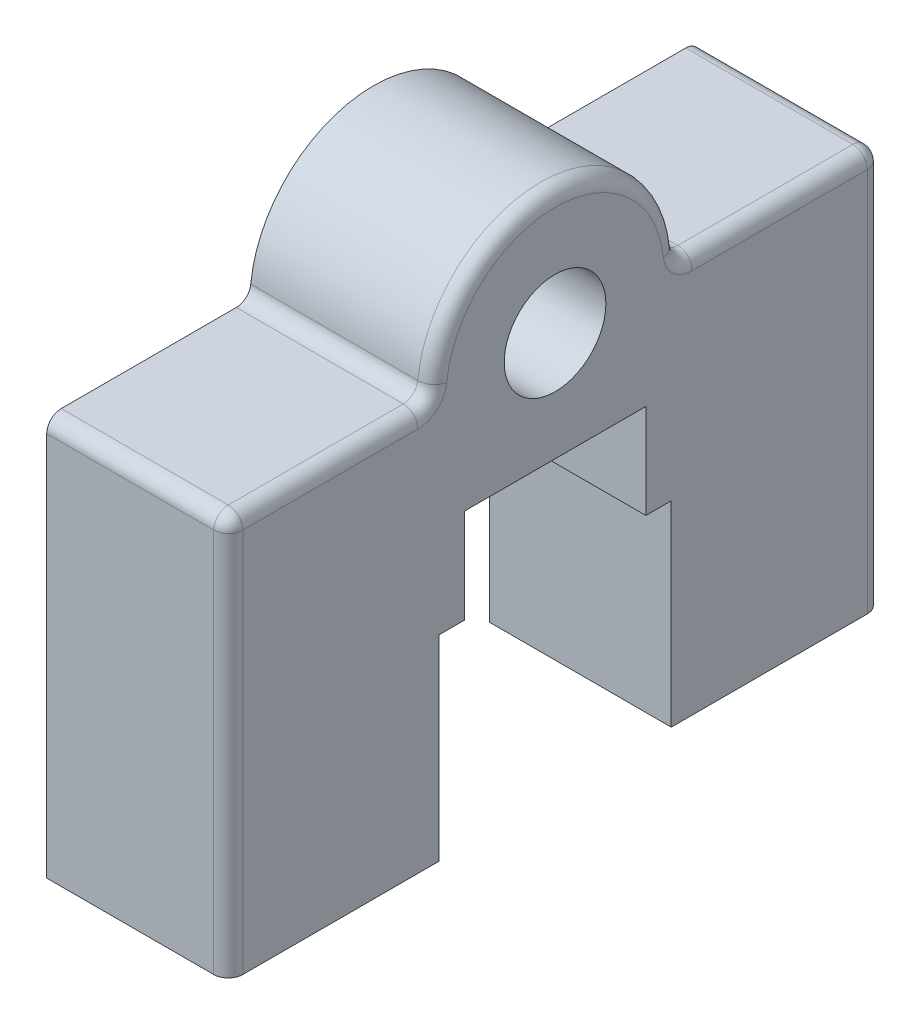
ISO-10303-21;
HEADER;
FILE_DESCRIPTION(('STEP AP214'),'2;1');
FILE_NAME('part.step','',(''),(''),'','','');
FILE_SCHEMA(('AUTOMOTIVE_DESIGN { 1 0 10303 214 1 1 1 1 }'));
ENDSEC;
DATA;
#1=APPLICATION_CONTEXT('core data for automotive mechanical design processes');
#2=APPLICATION_PROTOCOL_DEFINITION('international standard','automotive_design',2000,#1);
#3=PRODUCT_CONTEXT('',#1,'mechanical');
#4=PRODUCT('Part','Part','',(#3));
#5=PRODUCT_RELATED_PRODUCT_CATEGORY('part','',(#4));
#6=PRODUCT_DEFINITION_FORMATION('','',#4);
#7=PRODUCT_DEFINITION_CONTEXT('part definition',#1,'design');
#8=PRODUCT_DEFINITION('design','',#6,#7);
#9=PRODUCT_DEFINITION_SHAPE('','',#8);
#10=(LENGTH_UNIT() NAMED_UNIT(*) SI_UNIT(.MILLI.,.METRE.));
#11=(NAMED_UNIT(*) PLANE_ANGLE_UNIT() SI_UNIT($,.RADIAN.));
#12=(NAMED_UNIT(*) SI_UNIT($,.STERADIAN.) SOLID_ANGLE_UNIT());
#13=UNCERTAINTY_MEASURE_WITH_UNIT(LENGTH_MEASURE(1.E-05),#10,'distance_accuracy_value','');
#14=(GEOMETRIC_REPRESENTATION_CONTEXT(3) GLOBAL_UNCERTAINTY_ASSIGNED_CONTEXT((#13)) GLOBAL_UNIT_ASSIGNED_CONTEXT((#10,
#11,#12)) REPRESENTATION_CONTEXT('',''));
#15=CARTESIAN_POINT('',(0.,0.,0.));
#16=DIRECTION('',(0.,0.,1.));
#17=DIRECTION('',(1.,0.,0.));
#18=AXIS2_PLACEMENT_3D('',#15,#16,#17);
#19=CARTESIAN_POINT('',(25.,0.,45.));
#20=DIRECTION('',(0.,1.,0.));
#21=DIRECTION('',(0.,0.,1.));
#22=AXIS2_PLACEMENT_3D('',#19,#20,#21);
#23=PLANE('',#22);
#24=DIRECTION('',(0.,0.,-1.));
#25=VECTOR('',#24,1.);
#26=CARTESIAN_POINT('',(25.,0.,45.));
#27=LINE('',#26,#25);
#28=CARTESIAN_POINT('',(25.,0.,43.));
#29=VERTEX_POINT('',#28);
#30=CARTESIAN_POINT('',(25.,0.,16.));
#31=VERTEX_POINT('',#30);
#32=EDGE_CURVE('E236',#29,#31,#27,.T.);
#33=ORIENTED_EDGE('',*,*,#32,.F.);
#34=CARTESIAN_POINT('',(23.,0.,43.));
#35=DIRECTION('',(0.,1.,0.));
#36=DIRECTION('',(0.,0.,1.));
#37=AXIS2_PLACEMENT_3D('',#34,#35,#36);
#38=CIRCLE('',#37,2.);
#39=CARTESIAN_POINT('',(23.,0.,45.));
#40=VERTEX_POINT('',#39);
#41=EDGE_CURVE('E280',#29,#40,#38,.F.);
#42=ORIENTED_EDGE('',*,*,#41,.T.);
#43=DIRECTION('',(-1.,0.,0.));
#44=VECTOR('',#43,1.);
#45=CARTESIAN_POINT('',(25.,0.,45.));
#46=LINE('',#45,#44);
#47=CARTESIAN_POINT('',(0.,0.,45.));
#48=VERTEX_POINT('',#47);
#49=EDGE_CURVE('E212',#40,#48,#46,.T.);
#50=ORIENTED_EDGE('',*,*,#49,.T.);
#51=DIRECTION('',(0.,0.,-1.));
#52=VECTOR('',#51,1.);
#53=CARTESIAN_POINT('',(0.,0.,45.));
#54=LINE('',#53,#52);
#55=CARTESIAN_POINT('',(0.,0.,16.));
#56=VERTEX_POINT('',#55);
#57=EDGE_CURVE('E205',#48,#56,#54,.T.);
#58=ORIENTED_EDGE('',*,*,#57,.T.);
#59=DIRECTION('',(1.,0.,0.));
#60=VECTOR('',#59,1.);
#61=CARTESIAN_POINT('',(0.,0.,16.));
#62=LINE('',#61,#60);
#63=EDGE_CURVE('E186',#56,#31,#62,.T.);
#64=ORIENTED_EDGE('',*,*,#63,.T.);
#65=EDGE_LOOP('',(#33,#42,#50,#58,#64));
#66=FACE_BOUND('',#65,.T.);
#67=ADVANCED_FACE('F34',(#66),#23,.F.);
#68=CARTESIAN_POINT('',(25.,55.,0.));
#69=DIRECTION('',(1.,0.,0.));
#70=DIRECTION('',(0.,0.,-1.));
#71=AXIS2_PLACEMENT_3D('',#68,#69,#70);
#72=PLANE('',#71);
#73=DIRECTION('',(0.,0.,1.));
#74=VECTOR('',#73,1.);
#75=CARTESIAN_POINT('',(25.,53.,43.));
#76=LINE('',#75,#74);
#77=CARTESIAN_POINT('',(25.,53.,18.8944436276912));
#78=VERTEX_POINT('',#77);
#79=CARTESIAN_POINT('',(25.,53.,43.));
#80=VERTEX_POINT('',#79);
#81=EDGE_CURVE('E275',#78,#80,#76,.T.);
#82=ORIENTED_EDGE('',*,*,#81,.T.);
#83=DIRECTION('',(0.,-1.,0.));
#84=VECTOR('',#83,1.);
#85=CARTESIAN_POINT('',(25.,0.,43.));
#86=LINE('',#85,#84);
#87=EDGE_CURVE('E277',#80,#29,#86,.T.);
#88=ORIENTED_EDGE('',*,*,#87,.T.);
#89=ORIENTED_EDGE('',*,*,#32,.T.);
#90=DIRECTION('',(0.,-1.,0.));
#91=VECTOR('',#90,1.);
#92=CARTESIAN_POINT('',(25.,27.,16.));
#93=LINE('',#92,#91);
#94=CARTESIAN_POINT('',(25.,27.,16.));
#95=VERTEX_POINT('',#94);
#96=EDGE_CURVE('E192',#95,#31,#93,.T.);
#97=ORIENTED_EDGE('',*,*,#96,.F.);
#98=DIRECTION('',(0.,0.,1.));
#99=VECTOR('',#98,1.);
#100=CARTESIAN_POINT('',(25.,27.,16.));
#101=LINE('',#100,#99);
#102=CARTESIAN_POINT('',(25.,27.,12.5));
#103=VERTEX_POINT('',#102);
#104=EDGE_CURVE('E209',#103,#95,#101,.T.);
#105=ORIENTED_EDGE('',*,*,#104,.F.);
#106=DIRECTION('',(0.,-1.,0.));
#107=VECTOR('',#106,1.);
#108=CARTESIAN_POINT('',(25.,27.,12.5));
#109=LINE('',#108,#107);
#110=CARTESIAN_POINT('',(25.,40.,12.5));
#111=VERTEX_POINT('',#110);
#112=EDGE_CURVE('E340',#111,#103,#109,.T.);
#113=ORIENTED_EDGE('',*,*,#112,.F.);
#114=DIRECTION('',(0.,0.,1.));
#115=VECTOR('',#114,1.);
#116=CARTESIAN_POINT('',(25.,40.,12.5));
#117=LINE('',#116,#115);
#118=CARTESIAN_POINT('',(25.,40.,-12.5));
#119=VERTEX_POINT('',#118);
#120=EDGE_CURVE('E337',#119,#111,#117,.T.);
#121=ORIENTED_EDGE('',*,*,#120,.F.);
#122=DIRECTION('',(0.,1.,0.));
#123=VECTOR('',#122,1.);
#124=CARTESIAN_POINT('',(25.,27.,-12.5));
#125=LINE('',#124,#123);
#126=CARTESIAN_POINT('',(25.,27.,-12.5));
#127=VERTEX_POINT('',#126);
#128=EDGE_CURVE('E334',#127,#119,#125,.T.);
#129=ORIENTED_EDGE('',*,*,#128,.F.);
#130=DIRECTION('',(0.,0.,1.));
#131=VECTOR('',#130,1.);
#132=CARTESIAN_POINT('',(25.,27.,-12.5));
#133=LINE('',#132,#131);
#134=CARTESIAN_POINT('',(25.,27.,-16.));
#135=VERTEX_POINT('',#134);
#136=EDGE_CURVE('E327',#135,#127,#133,.T.);
#137=ORIENTED_EDGE('',*,*,#136,.F.);
#138=DIRECTION('',(0.,1.,0.));
#139=VECTOR('',#138,1.);
#140=CARTESIAN_POINT('',(25.,27.,-16.));
#141=LINE('',#140,#139);
#142=CARTESIAN_POINT('',(25.,0.,-16.));
#143=VERTEX_POINT('',#142);
#144=EDGE_CURVE('E324',#143,#135,#141,.T.);
#145=ORIENTED_EDGE('',*,*,#144,.F.);
#146=CARTESIAN_POINT('',(25.,0.,-43.));
#147=VERTEX_POINT('',#146);
#148=EDGE_CURVE('E233',#143,#147,#27,.T.);
#149=ORIENTED_EDGE('',*,*,#148,.T.);
#150=DIRECTION('',(0.,1.,0.));
#151=VECTOR('',#150,1.);
#152=CARTESIAN_POINT('',(25.,53.,-43.));
#153=LINE('',#152,#151);
#154=CARTESIAN_POINT('',(25.,53.,-43.));
#155=VERTEX_POINT('',#154);
#156=EDGE_CURVE('E265',#147,#155,#153,.T.);
#157=ORIENTED_EDGE('',*,*,#156,.T.);
#158=DIRECTION('',(0.,0.,1.));
#159=VECTOR('',#158,1.);
#160=CARTESIAN_POINT('',(25.,53.,-18.8944436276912));
#161=LINE('',#160,#159);
#162=CARTESIAN_POINT('',(25.,53.,-18.8944436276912));
#163=VERTEX_POINT('',#162);
#164=EDGE_CURVE('E267',#155,#163,#161,.T.);
#165=ORIENTED_EDGE('',*,*,#164,.T.);
#166=CARTESIAN_POINT('',(25.,57.,-18.8944436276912));
#167=DIRECTION('',(1.,0.,0.));
#168=DIRECTION('',(0.,0.,-1.));
#169=AXIS2_PLACEMENT_3D('',#166,#167,#168);
#170=CIRCLE('',#169,4.);
#171=CARTESIAN_POINT('',(25.,56.578947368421,-14.9166660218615));
#172=VERTEX_POINT('',#171);
#173=EDGE_CURVE('E269',#163,#172,#170,.F.);
#174=ORIENTED_EDGE('',*,*,#173,.T.);
#175=CARTESIAN_POINT('',(25.,55.,0.));
#176=DIRECTION('',(1.,0.,0.));
#177=DIRECTION('',(0.,0.,-1.));
#178=AXIS2_PLACEMENT_3D('',#175,#176,#177);
#179=CIRCLE('',#178,15.);
#180=CARTESIAN_POINT('',(25.,56.578947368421,14.9166660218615));
#181=VERTEX_POINT('',#180);
#182=EDGE_CURVE('E271',#172,#181,#179,.T.);
#183=ORIENTED_EDGE('',*,*,#182,.T.);
#184=CARTESIAN_POINT('',(25.,57.,18.8944436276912));
#185=DIRECTION('',(1.,0.,0.));
#186=DIRECTION('',(0.,0.,-1.));
#187=AXIS2_PLACEMENT_3D('',#184,#185,#186);
#188=CIRCLE('',#187,4.);
#189=EDGE_CURVE('E273',#181,#78,#188,.F.);
#190=ORIENTED_EDGE('',*,*,#189,.T.);
#191=EDGE_LOOP('',(#82,#88,#89,#97,#105,#113,#121,#129,#137,#145,#149,#157,#165,#174,#183,#190));
#192=FACE_BOUND('',#191,.T.);
#193=CARTESIAN_POINT('',(25.,55.,0.));
#194=DIRECTION('',(1.,0.,0.));
#195=DIRECTION('',(0.,0.,-1.));
#196=AXIS2_PLACEMENT_3D('',#193,#194,#195);
#197=CIRCLE('',#196,7.);
#198=CARTESIAN_POINT('',(25.,55.,-7.));
#199=VERTEX_POINT('',#198);
#200=EDGE_CURVE('E359',#199,#199,#197,.T.);
#201=ORIENTED_EDGE('',*,*,#200,.F.);
#202=EDGE_LOOP('',(#201));
#203=FACE_BOUND('',#202,.T.);
#204=ADVANCED_FACE('F368',(#192,#203),#72,.T.);
#205=CARTESIAN_POINT('',(0.,55.,0.));
#206=DIRECTION('',(1.,0.,0.));
#207=DIRECTION('',(0.,0.,-1.));
#208=AXIS2_PLACEMENT_3D('',#205,#206,#207);
#209=PLANE('',#208);
#210=DIRECTION('',(0.,0.,1.));
#211=VECTOR('',#210,1.);
#212=CARTESIAN_POINT('',(0.,55.,-17.));
#213=LINE('',#212,#211);
#214=CARTESIAN_POINT('',(0.,55.,-43.));
#215=VERTEX_POINT('',#214);
#216=CARTESIAN_POINT('',(0.,55.,-18.8944436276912));
#217=VERTEX_POINT('',#216);
#218=EDGE_CURVE('E218',#215,#217,#213,.T.);
#219=ORIENTED_EDGE('',*,*,#218,.F.);
#220=CARTESIAN_POINT('',(0.,53.,-43.));
#221=DIRECTION('',(1.,0.,0.));
#222=DIRECTION('',(0.,0.,-1.));
#223=AXIS2_PLACEMENT_3D('',#220,#221,#222);
#224=CIRCLE('',#223,2.);
#225=CARTESIAN_POINT('',(0.,53.,-45.));
#226=VERTEX_POINT('',#225);
#227=EDGE_CURVE('E245',#215,#226,#224,.F.);
#228=ORIENTED_EDGE('',*,*,#227,.T.);
#229=DIRECTION('',(0.,1.,0.));
#230=VECTOR('',#229,1.);
#231=CARTESIAN_POINT('',(0.,0.,-45.));
#232=LINE('',#231,#230);
#233=CARTESIAN_POINT('',(0.,0.,-45.));
#234=VERTEX_POINT('',#233);
#235=EDGE_CURVE('E214',#234,#226,#232,.T.);
#236=ORIENTED_EDGE('',*,*,#235,.F.);
#237=CARTESIAN_POINT('',(0.,0.,-16.));
#238=VERTEX_POINT('',#237);
#239=EDGE_CURVE('E215',#238,#234,#54,.T.);
#240=ORIENTED_EDGE('',*,*,#239,.F.);
#241=DIRECTION('',(0.,1.,0.));
#242=VECTOR('',#241,1.);
#243=CARTESIAN_POINT('',(0.,27.,-16.));
#244=LINE('',#243,#242);
#245=CARTESIAN_POINT('',(0.,27.,-16.));
#246=VERTEX_POINT('',#245);
#247=EDGE_CURVE('E208',#238,#246,#244,.T.);
#248=ORIENTED_EDGE('',*,*,#247,.T.);
#249=DIRECTION('',(0.,0.,1.));
#250=VECTOR('',#249,1.);
#251=CARTESIAN_POINT('',(0.,27.,-12.5));
#252=LINE('',#251,#250);
#253=CARTESIAN_POINT('',(0.,27.,-12.5));
#254=VERTEX_POINT('',#253);
#255=EDGE_CURVE('E513',#246,#254,#252,.T.);
#256=ORIENTED_EDGE('',*,*,#255,.T.);
#257=DIRECTION('',(0.,1.,0.));
#258=VECTOR('',#257,1.);
#259=CARTESIAN_POINT('',(0.,27.,-12.5));
#260=LINE('',#259,#258);
#261=CARTESIAN_POINT('',(0.,40.,-12.5));
#262=VERTEX_POINT('',#261);
#263=EDGE_CURVE('E516',#254,#262,#260,.T.);
#264=ORIENTED_EDGE('',*,*,#263,.T.);
#265=DIRECTION('',(0.,0.,1.));
#266=VECTOR('',#265,1.);
#267=CARTESIAN_POINT('',(0.,40.,12.5));
#268=LINE('',#267,#266);
#269=CARTESIAN_POINT('',(0.,40.,12.5));
#270=VERTEX_POINT('',#269);
#271=EDGE_CURVE('E508',#262,#270,#268,.T.);
#272=ORIENTED_EDGE('',*,*,#271,.T.);
#273=DIRECTION('',(0.,-1.,0.));
#274=VECTOR('',#273,1.);
#275=CARTESIAN_POINT('',(0.,27.,12.5));
#276=LINE('',#275,#274);
#277=CARTESIAN_POINT('',(0.,27.,12.5));
#278=VERTEX_POINT('',#277);
#279=EDGE_CURVE('E505',#270,#278,#276,.T.);
#280=ORIENTED_EDGE('',*,*,#279,.T.);
#281=DIRECTION('',(0.,0.,1.));
#282=VECTOR('',#281,1.);
#283=CARTESIAN_POINT('',(0.,27.,16.));
#284=LINE('',#283,#282);
#285=CARTESIAN_POINT('',(0.,27.,16.));
#286=VERTEX_POINT('',#285);
#287=EDGE_CURVE('E197',#278,#286,#284,.T.);
#288=ORIENTED_EDGE('',*,*,#287,.T.);
#289=DIRECTION('',(0.,-1.,0.));
#290=VECTOR('',#289,1.);
#291=CARTESIAN_POINT('',(0.,27.,16.));
#292=LINE('',#291,#290);
#293=EDGE_CURVE('E189',#286,#56,#292,.T.);
#294=ORIENTED_EDGE('',*,*,#293,.T.);
#295=ORIENTED_EDGE('',*,*,#57,.F.);
#296=DIRECTION('',(0.,-1.,0.));
#297=VECTOR('',#296,1.);
#298=CARTESIAN_POINT('',(0.,0.,45.));
#299=LINE('',#298,#297);
#300=CARTESIAN_POINT('',(0.,53.,45.));
#301=VERTEX_POINT('',#300);
#302=EDGE_CURVE('E221',#301,#48,#299,.T.);
#303=ORIENTED_EDGE('',*,*,#302,.F.);
#304=CARTESIAN_POINT('',(0.,53.,43.));
#305=DIRECTION('',(1.,0.,0.));
#306=DIRECTION('',(0.,0.,-1.));
#307=AXIS2_PLACEMENT_3D('',#304,#305,#306);
#308=CIRCLE('',#307,2.);
#309=CARTESIAN_POINT('',(0.,55.,43.));
#310=VERTEX_POINT('',#309);
#311=EDGE_CURVE('E243',#301,#310,#308,.F.);
#312=ORIENTED_EDGE('',*,*,#311,.T.);
#313=DIRECTION('',(0.,0.,1.));
#314=VECTOR('',#313,1.);
#315=CARTESIAN_POINT('',(0.,55.,45.));
#316=LINE('',#315,#314);
#317=CARTESIAN_POINT('',(0.,55.,18.8944436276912));
#318=VERTEX_POINT('',#317);
#319=EDGE_CURVE('E230',#318,#310,#316,.T.);
#320=ORIENTED_EDGE('',*,*,#319,.F.);
#321=CARTESIAN_POINT('',(0.,57.,18.8944436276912));
#322=DIRECTION('',(1.,0.,0.));
#323=DIRECTION('',(0.,0.,-1.));
#324=AXIS2_PLACEMENT_3D('',#321,#322,#323);
#325=CIRCLE('',#324,2.);
#326=CARTESIAN_POINT('',(0.,56.7894736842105,16.9055548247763));
#327=VERTEX_POINT('',#326);
#328=EDGE_CURVE('E263',#318,#327,#325,.T.);
#329=ORIENTED_EDGE('',*,*,#328,.T.);
#330=CARTESIAN_POINT('',(0.,55.,0.));
#331=DIRECTION('',(1.,0.,0.));
#332=DIRECTION('',(0.,0.,-1.));
#333=AXIS2_PLACEMENT_3D('',#330,#331,#332);
#334=CIRCLE('',#333,17.);
#335=CARTESIAN_POINT('',(0.,56.7894736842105,-16.9055548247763));
#336=VERTEX_POINT('',#335);
#337=EDGE_CURVE('E227',#336,#327,#334,.T.);
#338=ORIENTED_EDGE('',*,*,#337,.F.);
#339=CARTESIAN_POINT('',(0.,57.,-18.8944436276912));
#340=DIRECTION('',(1.,0.,0.));
#341=DIRECTION('',(0.,0.,-1.));
#342=AXIS2_PLACEMENT_3D('',#339,#340,#341);
#343=CIRCLE('',#342,2.);
#344=EDGE_CURVE('E261',#336,#217,#343,.T.);
#345=ORIENTED_EDGE('',*,*,#344,.T.);
#346=EDGE_LOOP('',(#219,#228,#236,#240,#248,#256,#264,#272,#280,#288,#294,#295,#303,#312,#320,
#329,#338,#345));
#347=FACE_BOUND('',#346,.T.);
#348=CARTESIAN_POINT('',(0.,55.,0.));
#349=DIRECTION('',(1.,0.,0.));
#350=DIRECTION('',(0.,0.,-1.));
#351=AXIS2_PLACEMENT_3D('',#348,#349,#350);
#352=CIRCLE('',#351,7.);
#353=CARTESIAN_POINT('',(0.,55.,-7.));
#354=VERTEX_POINT('',#353);
#355=EDGE_CURVE('E347',#354,#354,#352,.T.);
#356=ORIENTED_EDGE('',*,*,#355,.T.);
#357=EDGE_LOOP('',(#356));
#358=FACE_BOUND('',#357,.T.);
#359=ADVANCED_FACE('F202',(#347,#358),#209,.F.);
#360=CARTESIAN_POINT('',(25.,0.,45.));
#361=DIRECTION('',(0.,0.,-1.));
#362=DIRECTION('',(-1.,0.,0.));
#363=AXIS2_PLACEMENT_3D('',#360,#361,#362);
#364=PLANE('',#363);
#365=ORIENTED_EDGE('',*,*,#49,.F.);
#366=DIRECTION('',(0.,-1.,0.));
#367=VECTOR('',#366,1.);
#368=CARTESIAN_POINT('',(23.,53.,45.));
#369=LINE('',#368,#367);
#370=CARTESIAN_POINT('',(23.,53.,45.));
#371=VERTEX_POINT('',#370);
#372=EDGE_CURVE('E282',#40,#371,#369,.F.);
#373=ORIENTED_EDGE('',*,*,#372,.T.);
#374=DIRECTION('',(-1.,0.,0.));
#375=VECTOR('',#374,1.);
#376=CARTESIAN_POINT('',(25.,53.,45.));
#377=LINE('',#376,#375);
#378=EDGE_CURVE('E259',#371,#301,#377,.T.);
#379=ORIENTED_EDGE('',*,*,#378,.T.);
#380=ORIENTED_EDGE('',*,*,#302,.T.);
#381=EDGE_LOOP('',(#365,#373,#379,#380));
#382=FACE_BOUND('',#381,.T.);
#383=ADVANCED_FACE('F407',(#382),#364,.F.);
#384=DIRECTION('',(-1.,0.,0.));
#385=VECTOR('',#384,1.);
#386=CARTESIAN_POINT('',(25.,0.,-45.));
#387=LINE('',#386,#385);
#388=CARTESIAN_POINT('',(23.,0.,-45.));
#389=VERTEX_POINT('',#388);
#390=EDGE_CURVE('E234',#389,#234,#387,.T.);
#391=ORIENTED_EDGE('',*,*,#390,.F.);
#392=CARTESIAN_POINT('',(23.,0.,-43.));
#393=DIRECTION('',(0.,1.,0.));
#394=DIRECTION('',(0.,0.,1.));
#395=AXIS2_PLACEMENT_3D('',#392,#393,#394);
#396=CIRCLE('',#395,2.);
#397=EDGE_CURVE('E11',#389,#147,#396,.F.);
#398=ORIENTED_EDGE('',*,*,#397,.T.);
#399=ORIENTED_EDGE('',*,*,#148,.F.);
#400=DIRECTION('',(1.,0.,0.));
#401=VECTOR('',#400,1.);
#402=CARTESIAN_POINT('',(0.,0.,-16.));
#403=LINE('',#402,#401);
#404=EDGE_CURVE('E196',#238,#143,#403,.T.);
#405=ORIENTED_EDGE('',*,*,#404,.F.);
#406=ORIENTED_EDGE('',*,*,#239,.T.);
#407=EDGE_LOOP('',(#391,#398,#399,#405,#406));
#408=FACE_BOUND('',#407,.T.);
#409=ADVANCED_FACE('F431',(#408),#23,.F.);
#410=CARTESIAN_POINT('',(25.,0.,-45.));
#411=DIRECTION('',(0.,0.,1.));
#412=DIRECTION('',(1.,0.,0.));
#413=AXIS2_PLACEMENT_3D('',#410,#411,#412);
#414=PLANE('',#413);
#415=DIRECTION('',(-1.,0.,0.));
#416=VECTOR('',#415,1.);
#417=CARTESIAN_POINT('',(25.,53.,-45.));
#418=LINE('',#417,#416);
#419=CARTESIAN_POINT('',(23.,53.,-45.));
#420=VERTEX_POINT('',#419);
#421=EDGE_CURVE('E247',#226,#420,#418,.F.);
#422=ORIENTED_EDGE('',*,*,#421,.T.);
#423=DIRECTION('',(0.,1.,0.));
#424=VECTOR('',#423,1.);
#425=CARTESIAN_POINT('',(23.,0.,-45.));
#426=LINE('',#425,#424);
#427=EDGE_CURVE('E43',#420,#389,#426,.F.);
#428=ORIENTED_EDGE('',*,*,#427,.T.);
#429=ORIENTED_EDGE('',*,*,#390,.T.);
#430=ORIENTED_EDGE('',*,*,#235,.T.);
#431=EDGE_LOOP('',(#422,#428,#429,#430));
#432=FACE_BOUND('',#431,.T.);
#433=ADVANCED_FACE('F439',(#432),#414,.F.);
#434=CARTESIAN_POINT('',(25.,55.,-17.));
#435=DIRECTION('',(0.,-1.,0.));
#436=DIRECTION('',(0.,0.,-1.));
#437=AXIS2_PLACEMENT_3D('',#434,#435,#436);
#438=PLANE('',#437);
#439=DIRECTION('',(1.,0.,0.));
#440=VECTOR('',#439,1.);
#441=CARTESIAN_POINT('',(25.,55.,-18.8944436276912));
#442=LINE('',#441,#440);
#443=CARTESIAN_POINT('',(23.,55.,-18.8944436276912));
#444=VERTEX_POINT('',#443);
#445=EDGE_CURVE('E238',#217,#444,#442,.T.);
#446=ORIENTED_EDGE('',*,*,#445,.T.);
#447=DIRECTION('',(0.,0.,1.));
#448=VECTOR('',#447,1.);
#449=CARTESIAN_POINT('',(23.,55.,-43.));
#450=LINE('',#449,#448);
#451=CARTESIAN_POINT('',(23.,55.,-43.));
#452=VERTEX_POINT('',#451);
#453=EDGE_CURVE('E294',#444,#452,#450,.F.);
#454=ORIENTED_EDGE('',*,*,#453,.T.);
#455=DIRECTION('',(-1.,0.,0.));
#456=VECTOR('',#455,1.);
#457=CARTESIAN_POINT('',(25.,55.,-43.));
#458=LINE('',#457,#456);
#459=EDGE_CURVE('E241',#452,#215,#458,.T.);
#460=ORIENTED_EDGE('',*,*,#459,.T.);
#461=ORIENTED_EDGE('',*,*,#218,.T.);
#462=EDGE_LOOP('',(#446,#454,#460,#461));
#463=FACE_BOUND('',#462,.T.);
#464=ADVANCED_FACE('F444',(#463),#438,.F.);
#465=CARTESIAN_POINT('',(25.,55.,0.));
#466=DIRECTION('',(-1.,0.,0.));
#467=DIRECTION('',(0.,0.,1.));
#468=AXIS2_PLACEMENT_3D('',#465,#466,#467);
#469=CYLINDRICAL_SURFACE('',#468,17.);
#470=DIRECTION('',(-1.,0.,0.));
#471=VECTOR('',#470,1.);
#472=CARTESIAN_POINT('',(25.,56.7894736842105,16.9055548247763));
#473=LINE('',#472,#471);
#474=CARTESIAN_POINT('',(23.,56.7894736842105,16.9055548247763));
#475=VERTEX_POINT('',#474);
#476=EDGE_CURVE('E249',#327,#475,#473,.F.);
#477=ORIENTED_EDGE('',*,*,#476,.T.);
#478=CARTESIAN_POINT('',(23.,55.,0.));
#479=DIRECTION('',(1.,0.,0.));
#480=DIRECTION('',(0.,0.,-1.));
#481=AXIS2_PLACEMENT_3D('',#478,#479,#480);
#482=CIRCLE('',#481,17.);
#483=CARTESIAN_POINT('',(23.,56.7894736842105,-16.9055548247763));
#484=VERTEX_POINT('',#483);
#485=EDGE_CURVE('E290',#475,#484,#482,.F.);
#486=ORIENTED_EDGE('',*,*,#485,.T.);
#487=DIRECTION('',(-1.,0.,0.));
#488=VECTOR('',#487,1.);
#489=CARTESIAN_POINT('',(25.,56.7894736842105,-16.9055548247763));
#490=LINE('',#489,#488);
#491=EDGE_CURVE('E252',#484,#336,#490,.T.);
#492=ORIENTED_EDGE('',*,*,#491,.T.);
#493=ORIENTED_EDGE('',*,*,#337,.T.);
#494=EDGE_LOOP('',(#477,#486,#492,#493));
#495=FACE_BOUND('',#494,.T.);
#496=ADVANCED_FACE('F456',(#495),#469,.T.);
#497=CARTESIAN_POINT('',(25.,55.,45.));
#498=DIRECTION('',(0.,-1.,0.));
#499=DIRECTION('',(0.,0.,-1.));
#500=AXIS2_PLACEMENT_3D('',#497,#498,#499);
#501=PLANE('',#500);
#502=DIRECTION('',(-1.,0.,0.));
#503=VECTOR('',#502,1.);
#504=CARTESIAN_POINT('',(25.,55.,43.));
#505=LINE('',#504,#503);
#506=CARTESIAN_POINT('',(23.,55.,43.));
#507=VERTEX_POINT('',#506);
#508=EDGE_CURVE('E254',#310,#507,#505,.F.);
#509=ORIENTED_EDGE('',*,*,#508,.T.);
#510=DIRECTION('',(0.,0.,1.));
#511=VECTOR('',#510,1.);
#512=CARTESIAN_POINT('',(23.,55.,18.8944436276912));
#513=LINE('',#512,#511);
#514=CARTESIAN_POINT('',(23.,55.,18.8944436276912));
#515=VERTEX_POINT('',#514);
#516=EDGE_CURVE('E286',#507,#515,#513,.F.);
#517=ORIENTED_EDGE('',*,*,#516,.T.);
#518=DIRECTION('',(1.,0.,0.));
#519=VECTOR('',#518,1.);
#520=CARTESIAN_POINT('',(0.,55.,18.8944436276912));
#521=LINE('',#520,#519);
#522=EDGE_CURVE('E257',#515,#318,#521,.F.);
#523=ORIENTED_EDGE('',*,*,#522,.T.);
#524=ORIENTED_EDGE('',*,*,#319,.T.);
#525=EDGE_LOOP('',(#509,#517,#523,#524));
#526=FACE_BOUND('',#525,.T.);
#527=ADVANCED_FACE('F414',(#526),#501,.F.);
#528=CARTESIAN_POINT('',(25.,55.,0.));
#529=DIRECTION('',(-1.,0.,0.));
#530=DIRECTION('',(0.,0.,1.));
#531=AXIS2_PLACEMENT_3D('',#528,#529,#530);
#532=CYLINDRICAL_SURFACE('',#531,7.);
#533=ORIENTED_EDGE('',*,*,#200,.T.);
#534=EDGE_LOOP('',(#533));
#535=FACE_BOUND('',#534,.T.);
#536=ORIENTED_EDGE('',*,*,#355,.F.);
#537=EDGE_LOOP('',(#536));
#538=FACE_BOUND('',#537,.T.);
#539=ADVANCED_FACE('F464',(#535,#538),#532,.F.);
#540=CARTESIAN_POINT('',(0.,27.,16.));
#541=DIRECTION('',(0.,0.,1.));
#542=DIRECTION('',(1.,0.,0.));
#543=AXIS2_PLACEMENT_3D('',#540,#541,#542);
#544=PLANE('',#543);
#545=ORIENTED_EDGE('',*,*,#96,.T.);
#546=ORIENTED_EDGE('',*,*,#63,.F.);
#547=ORIENTED_EDGE('',*,*,#293,.F.);
#548=DIRECTION('',(1.,0.,0.));
#549=VECTOR('',#548,1.);
#550=CARTESIAN_POINT('',(0.,27.,16.));
#551=LINE('',#550,#549);
#552=EDGE_CURVE('E345',#286,#95,#551,.T.);
#553=ORIENTED_EDGE('',*,*,#552,.T.);
#554=EDGE_LOOP('',(#545,#546,#547,#553));
#555=FACE_BOUND('',#554,.T.);
#556=ADVANCED_FACE('F188',(#555),#544,.F.);
#557=CARTESIAN_POINT('',(0.,27.,16.));
#558=DIRECTION('',(0.,1.,0.));
#559=DIRECTION('',(0.,0.,1.));
#560=AXIS2_PLACEMENT_3D('',#557,#558,#559);
#561=PLANE('',#560);
#562=ORIENTED_EDGE('',*,*,#104,.T.);
#563=ORIENTED_EDGE('',*,*,#552,.F.);
#564=ORIENTED_EDGE('',*,*,#287,.F.);
#565=DIRECTION('',(1.,0.,0.));
#566=VECTOR('',#565,1.);
#567=CARTESIAN_POINT('',(0.,27.,12.5));
#568=LINE('',#567,#566);
#569=EDGE_CURVE('E348',#278,#103,#568,.T.);
#570=ORIENTED_EDGE('',*,*,#569,.T.);
#571=EDGE_LOOP('',(#562,#563,#564,#570));
#572=FACE_BOUND('',#571,.T.);
#573=ADVANCED_FACE('F475',(#572),#561,.F.);
#574=CARTESIAN_POINT('',(0.,27.,12.5));
#575=DIRECTION('',(0.,0.,1.));
#576=DIRECTION('',(1.,0.,0.));
#577=AXIS2_PLACEMENT_3D('',#574,#575,#576);
#578=PLANE('',#577);
#579=ORIENTED_EDGE('',*,*,#112,.T.);
#580=ORIENTED_EDGE('',*,*,#569,.F.);
#581=ORIENTED_EDGE('',*,*,#279,.F.);
#582=DIRECTION('',(1.,0.,0.));
#583=VECTOR('',#582,1.);
#584=CARTESIAN_POINT('',(0.,40.,12.5));
#585=LINE('',#584,#583);
#586=EDGE_CURVE('E350',#270,#111,#585,.T.);
#587=ORIENTED_EDGE('',*,*,#586,.T.);
#588=EDGE_LOOP('',(#579,#580,#581,#587));
#589=FACE_BOUND('',#588,.T.);
#590=ADVANCED_FACE('F491',(#589),#578,.F.);
#591=CARTESIAN_POINT('',(0.,40.,12.5));
#592=DIRECTION('',(0.,1.,0.));
#593=DIRECTION('',(0.,0.,1.));
#594=AXIS2_PLACEMENT_3D('',#591,#592,#593);
#595=PLANE('',#594);
#596=ORIENTED_EDGE('',*,*,#120,.T.);
#597=ORIENTED_EDGE('',*,*,#586,.F.);
#598=ORIENTED_EDGE('',*,*,#271,.F.);
#599=DIRECTION('',(1.,0.,0.));
#600=VECTOR('',#599,1.);
#601=CARTESIAN_POINT('',(0.,40.,-12.5));
#602=LINE('',#601,#600);
#603=EDGE_CURVE('E352',#262,#119,#602,.T.);
#604=ORIENTED_EDGE('',*,*,#603,.T.);
#605=EDGE_LOOP('',(#596,#597,#598,#604));
#606=FACE_BOUND('',#605,.T.);
#607=ADVANCED_FACE('F487',(#606),#595,.F.);
#608=CARTESIAN_POINT('',(0.,27.,-12.5));
#609=DIRECTION('',(0.,0.,-1.));
#610=DIRECTION('',(-1.,0.,0.));
#611=AXIS2_PLACEMENT_3D('',#608,#609,#610);
#612=PLANE('',#611);
#613=ORIENTED_EDGE('',*,*,#128,.T.);
#614=ORIENTED_EDGE('',*,*,#603,.F.);
#615=ORIENTED_EDGE('',*,*,#263,.F.);
#616=DIRECTION('',(1.,0.,0.));
#617=VECTOR('',#616,1.);
#618=CARTESIAN_POINT('',(0.,27.,-12.5));
#619=LINE('',#618,#617);
#620=EDGE_CURVE('E354',#254,#127,#619,.T.);
#621=ORIENTED_EDGE('',*,*,#620,.T.);
#622=EDGE_LOOP('',(#613,#614,#615,#621));
#623=FACE_BOUND('',#622,.T.);
#624=ADVANCED_FACE('F483',(#623),#612,.F.);
#625=CARTESIAN_POINT('',(0.,27.,-12.5));
#626=DIRECTION('',(0.,1.,0.));
#627=DIRECTION('',(0.,0.,1.));
#628=AXIS2_PLACEMENT_3D('',#625,#626,#627);
#629=PLANE('',#628);
#630=ORIENTED_EDGE('',*,*,#136,.T.);
#631=ORIENTED_EDGE('',*,*,#620,.F.);
#632=ORIENTED_EDGE('',*,*,#255,.F.);
#633=DIRECTION('',(1.,0.,0.));
#634=VECTOR('',#633,1.);
#635=CARTESIAN_POINT('',(0.,27.,-16.));
#636=LINE('',#635,#634);
#637=EDGE_CURVE('E356',#246,#135,#636,.T.);
#638=ORIENTED_EDGE('',*,*,#637,.T.);
#639=EDGE_LOOP('',(#630,#631,#632,#638));
#640=FACE_BOUND('',#639,.T.);
#641=ADVANCED_FACE('F479',(#640),#629,.F.);
#642=CARTESIAN_POINT('',(0.,27.,-16.));
#643=DIRECTION('',(0.,0.,-1.));
#644=DIRECTION('',(0.,1.,0.));
#645=AXIS2_PLACEMENT_3D('',#642,#643,#644);
#646=PLANE('',#645);
#647=ORIENTED_EDGE('',*,*,#144,.T.);
#648=ORIENTED_EDGE('',*,*,#637,.F.);
#649=ORIENTED_EDGE('',*,*,#247,.F.);
#650=ORIENTED_EDGE('',*,*,#404,.T.);
#651=EDGE_LOOP('',(#647,#648,#649,#650));
#652=FACE_BOUND('',#651,.T.);
#653=ADVANCED_FACE('F476',(#652),#646,.F.);
#654=CARTESIAN_POINT('',(25.,53.,-43.));
#655=DIRECTION('',(-1.,0.,0.));
#656=DIRECTION('',(0.,0.,1.));
#657=AXIS2_PLACEMENT_3D('',#654,#655,#656);
#658=CYLINDRICAL_SURFACE('',#657,2.);
#659=ORIENTED_EDGE('',*,*,#459,.F.);
#660=CARTESIAN_POINT('',(23.,53.,-43.));
#661=DIRECTION('',(-1.,0.,0.));
#662=DIRECTION('',(0.,0.,1.));
#663=AXIS2_PLACEMENT_3D('',#660,#661,#662);
#664=CIRCLE('',#663,2.);
#665=EDGE_CURVE('E58',#452,#420,#664,.T.);
#666=ORIENTED_EDGE('',*,*,#665,.T.);
#667=ORIENTED_EDGE('',*,*,#421,.F.);
#668=ORIENTED_EDGE('',*,*,#227,.F.);
#669=EDGE_LOOP('',(#659,#666,#667,#668));
#670=FACE_BOUND('',#669,.T.);
#671=ADVANCED_FACE('F448',(#670),#658,.T.);
#672=CARTESIAN_POINT('',(25.,57.,-18.8944436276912));
#673=DIRECTION('',(-1.,0.,0.));
#674=DIRECTION('',(0.,0.,1.));
#675=AXIS2_PLACEMENT_3D('',#672,#673,#674);
#676=CYLINDRICAL_SURFACE('',#675,2.);
#677=ORIENTED_EDGE('',*,*,#491,.F.);
#678=CARTESIAN_POINT('',(23.,57.,-18.8944436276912));
#679=DIRECTION('',(1.,0.,0.));
#680=DIRECTION('',(0.,0.,-1.));
#681=AXIS2_PLACEMENT_3D('',#678,#679,#680);
#682=CIRCLE('',#681,2.);
#683=EDGE_CURVE('E292',#484,#444,#682,.T.);
#684=ORIENTED_EDGE('',*,*,#683,.T.);
#685=ORIENTED_EDGE('',*,*,#445,.F.);
#686=ORIENTED_EDGE('',*,*,#344,.F.);
#687=EDGE_LOOP('',(#677,#684,#685,#686));
#688=FACE_BOUND('',#687,.T.);
#689=ADVANCED_FACE('F425',(#688),#676,.F.);
#690=CARTESIAN_POINT('',(25.,57.,18.8944436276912));
#691=DIRECTION('',(-1.,0.,0.));
#692=DIRECTION('',(0.,0.,1.));
#693=AXIS2_PLACEMENT_3D('',#690,#691,#692);
#694=CYLINDRICAL_SURFACE('',#693,2.);
#695=ORIENTED_EDGE('',*,*,#522,.F.);
#696=CARTESIAN_POINT('',(23.,57.,18.8944436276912));
#697=DIRECTION('',(1.,0.,0.));
#698=DIRECTION('',(0.,0.,-1.));
#699=AXIS2_PLACEMENT_3D('',#696,#697,#698);
#700=CIRCLE('',#699,2.);
#701=EDGE_CURVE('E288',#515,#475,#700,.T.);
#702=ORIENTED_EDGE('',*,*,#701,.T.);
#703=ORIENTED_EDGE('',*,*,#476,.F.);
#704=ORIENTED_EDGE('',*,*,#328,.F.);
#705=EDGE_LOOP('',(#695,#702,#703,#704));
#706=FACE_BOUND('',#705,.T.);
#707=ADVANCED_FACE('F419',(#706),#694,.F.);
#708=CARTESIAN_POINT('',(25.,53.,43.));
#709=DIRECTION('',(-1.,0.,0.));
#710=DIRECTION('',(0.,0.,1.));
#711=AXIS2_PLACEMENT_3D('',#708,#709,#710);
#712=CYLINDRICAL_SURFACE('',#711,2.);
#713=ORIENTED_EDGE('',*,*,#378,.F.);
#714=CARTESIAN_POINT('',(23.,53.,43.));
#715=DIRECTION('',(-1.,0.,0.));
#716=DIRECTION('',(0.,0.,1.));
#717=AXIS2_PLACEMENT_3D('',#714,#715,#716);
#718=CIRCLE('',#717,2.);
#719=EDGE_CURVE('E284',#371,#507,#718,.T.);
#720=ORIENTED_EDGE('',*,*,#719,.T.);
#721=ORIENTED_EDGE('',*,*,#508,.F.);
#722=ORIENTED_EDGE('',*,*,#311,.F.);
#723=EDGE_LOOP('',(#713,#720,#721,#722));
#724=FACE_BOUND('',#723,.T.);
#725=ADVANCED_FACE('F417',(#724),#712,.T.);
#726=CARTESIAN_POINT('',(23.,55.,-43.));
#727=DIRECTION('',(0.,-1.,0.));
#728=DIRECTION('',(0.,0.,-1.));
#729=AXIS2_PLACEMENT_3D('',#726,#727,#728);
#730=CYLINDRICAL_SURFACE('',#729,2.);
#731=ORIENTED_EDGE('',*,*,#397,.F.);
#732=ORIENTED_EDGE('',*,*,#427,.F.);
#733=CARTESIAN_POINT('',(23.,53.,-43.));
#734=DIRECTION('',(0.,1.,0.));
#735=DIRECTION('',(0.,0.,1.));
#736=AXIS2_PLACEMENT_3D('',#733,#734,#735);
#737=CIRCLE('',#736,2.);
#738=EDGE_CURVE('E38',#155,#420,#737,.T.);
#739=ORIENTED_EDGE('',*,*,#738,.F.);
#740=ORIENTED_EDGE('',*,*,#156,.F.);
#741=EDGE_LOOP('',(#731,#732,#739,#740));
#742=FACE_BOUND('',#741,.T.);
#743=ADVANCED_FACE('F36',(#742),#730,.T.);
#744=CARTESIAN_POINT('',(23.,53.,-43.));
#745=DIRECTION('',(0.,0.,1.));
#746=DIRECTION('',(1.,0.,0.));
#747=AXIS2_PLACEMENT_3D('',#744,#745,#746);
#748=SPHERICAL_SURFACE('',#747,2.);
#749=ORIENTED_EDGE('',*,*,#738,.T.);
#750=ORIENTED_EDGE('',*,*,#665,.F.);
#751=CARTESIAN_POINT('',(23.,53.,-43.));
#752=DIRECTION('',(0.,0.,1.));
#753=DIRECTION('',(1.,0.,0.));
#754=AXIS2_PLACEMENT_3D('',#751,#752,#753);
#755=CIRCLE('',#754,2.);
#756=EDGE_CURVE('E315',#155,#452,#755,.T.);
#757=ORIENTED_EDGE('',*,*,#756,.F.);
#758=EDGE_LOOP('',(#749,#750,#757));
#759=FACE_BOUND('',#758,.T.);
#760=ADVANCED_FACE('F375',(#759),#748,.T.);
#761=CARTESIAN_POINT('',(23.,53.,0.));
#762=DIRECTION('',(0.,0.,-1.));
#763=DIRECTION('',(0.,1.,0.));
#764=AXIS2_PLACEMENT_3D('',#761,#762,#763);
#765=CYLINDRICAL_SURFACE('',#764,2.);
#766=ORIENTED_EDGE('',*,*,#756,.T.);
#767=ORIENTED_EDGE('',*,*,#453,.F.);
#768=CARTESIAN_POINT('',(23.,53.,-18.8944436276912));
#769=DIRECTION('',(0.,0.,1.));
#770=DIRECTION('',(1.,0.,0.));
#771=AXIS2_PLACEMENT_3D('',#768,#769,#770);
#772=CIRCLE('',#771,2.);
#773=EDGE_CURVE('E313',#163,#444,#772,.T.);
#774=ORIENTED_EDGE('',*,*,#773,.F.);
#775=ORIENTED_EDGE('',*,*,#164,.F.);
#776=EDGE_LOOP('',(#766,#767,#774,#775));
#777=FACE_BOUND('',#776,.T.);
#778=ADVANCED_FACE('F377',(#777),#765,.T.);
#779=CARTESIAN_POINT('',(23.,57.,-18.8944436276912));
#780=DIRECTION('',(1.,0.,0.));
#781=DIRECTION('',(0.,0.,-1.));
#782=AXIS2_PLACEMENT_3D('',#779,#780,#781);
#783=TOROIDAL_SURFACE('',#782,4.,2.);
#784=ORIENTED_EDGE('',*,*,#773,.T.);
#785=ORIENTED_EDGE('',*,*,#683,.F.);
#786=CARTESIAN_POINT('',(23.,56.578947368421,-14.9166660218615));
#787=DIRECTION('',(0.,0.994444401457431,0.105263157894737));
#788=DIRECTION('',(0.,-0.105263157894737,0.994444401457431));
#789=AXIS2_PLACEMENT_3D('',#786,#787,#788);
#790=CIRCLE('',#789,2.);
#791=EDGE_CURVE('E310',#172,#484,#790,.T.);
#792=ORIENTED_EDGE('',*,*,#791,.F.);
#793=ORIENTED_EDGE('',*,*,#173,.F.);
#794=EDGE_LOOP('',(#784,#785,#792,#793));
#795=FACE_BOUND('',#794,.T.);
#796=ADVANCED_FACE('F384',(#795),#783,.T.);
#797=CARTESIAN_POINT('',(23.,55.,0.));
#798=DIRECTION('',(1.,0.,0.));
#799=DIRECTION('',(0.,0.,-1.));
#800=AXIS2_PLACEMENT_3D('',#797,#798,#799);
#801=TOROIDAL_SURFACE('',#800,15.,2.);
#802=ORIENTED_EDGE('',*,*,#791,.T.);
#803=ORIENTED_EDGE('',*,*,#485,.F.);
#804=CARTESIAN_POINT('',(23.,56.578947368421,14.9166660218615));
#805=DIRECTION('',(0.,-0.994444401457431,0.105263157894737));
#806=DIRECTION('',(0.,-0.105263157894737,-0.994444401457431));
#807=AXIS2_PLACEMENT_3D('',#804,#805,#806);
#808=CIRCLE('',#807,2.);
#809=EDGE_CURVE('E307',#181,#475,#808,.T.);
#810=ORIENTED_EDGE('',*,*,#809,.F.);
#811=ORIENTED_EDGE('',*,*,#182,.F.);
#812=EDGE_LOOP('',(#802,#803,#810,#811));
#813=FACE_BOUND('',#812,.T.);
#814=ADVANCED_FACE('F387',(#813),#801,.T.);
#815=CARTESIAN_POINT('',(23.,57.,18.8944436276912));
#816=DIRECTION('',(1.,0.,0.));
#817=DIRECTION('',(0.,0.,-1.));
#818=AXIS2_PLACEMENT_3D('',#815,#816,#817);
#819=TOROIDAL_SURFACE('',#818,4.,2.);
#820=ORIENTED_EDGE('',*,*,#809,.T.);
#821=ORIENTED_EDGE('',*,*,#701,.F.);
#822=CARTESIAN_POINT('',(23.,53.,18.8944436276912));
#823=DIRECTION('',(0.,0.,1.));
#824=DIRECTION('',(1.,0.,0.));
#825=AXIS2_PLACEMENT_3D('',#822,#823,#824);
#826=CIRCLE('',#825,2.);
#827=EDGE_CURVE('E304',#78,#515,#826,.T.);
#828=ORIENTED_EDGE('',*,*,#827,.F.);
#829=ORIENTED_EDGE('',*,*,#189,.F.);
#830=EDGE_LOOP('',(#820,#821,#828,#829));
#831=FACE_BOUND('',#830,.T.);
#832=ADVANCED_FACE('F392',(#831),#819,.T.);
#833=CARTESIAN_POINT('',(23.,53.,0.));
#834=DIRECTION('',(0.,0.,-1.));
#835=DIRECTION('',(0.,1.,0.));
#836=AXIS2_PLACEMENT_3D('',#833,#834,#835);
#837=CYLINDRICAL_SURFACE('',#836,2.);
#838=ORIENTED_EDGE('',*,*,#827,.T.);
#839=ORIENTED_EDGE('',*,*,#516,.F.);
#840=CARTESIAN_POINT('',(23.,53.,43.));
#841=DIRECTION('',(0.,0.,1.));
#842=DIRECTION('',(1.,0.,0.));
#843=AXIS2_PLACEMENT_3D('',#840,#841,#842);
#844=CIRCLE('',#843,2.);
#845=EDGE_CURVE('E301',#80,#507,#844,.T.);
#846=ORIENTED_EDGE('',*,*,#845,.F.);
#847=ORIENTED_EDGE('',*,*,#81,.F.);
#848=EDGE_LOOP('',(#838,#839,#846,#847));
#849=FACE_BOUND('',#848,.T.);
#850=ADVANCED_FACE('F399',(#849),#837,.T.);
#851=CARTESIAN_POINT('',(23.,53.,43.));
#852=DIRECTION('',(0.,0.,1.));
#853=DIRECTION('',(1.,0.,0.));
#854=AXIS2_PLACEMENT_3D('',#851,#852,#853);
#855=SPHERICAL_SURFACE('',#854,2.);
#856=ORIENTED_EDGE('',*,*,#845,.T.);
#857=ORIENTED_EDGE('',*,*,#719,.F.);
#858=CARTESIAN_POINT('',(23.,53.,43.));
#859=DIRECTION('',(0.,-1.,0.));
#860=DIRECTION('',(0.,0.,-1.));
#861=AXIS2_PLACEMENT_3D('',#858,#859,#860);
#862=CIRCLE('',#861,2.);
#863=EDGE_CURVE('E298',#80,#371,#862,.T.);
#864=ORIENTED_EDGE('',*,*,#863,.F.);
#865=EDGE_LOOP('',(#856,#857,#864));
#866=FACE_BOUND('',#865,.T.);
#867=ADVANCED_FACE('F402',(#866),#855,.T.);
#868=CARTESIAN_POINT('',(23.,55.,43.));
#869=DIRECTION('',(0.,1.,0.));
#870=DIRECTION('',(0.,0.,1.));
#871=AXIS2_PLACEMENT_3D('',#868,#869,#870);
#872=CYLINDRICAL_SURFACE('',#871,2.);
#873=ORIENTED_EDGE('',*,*,#863,.T.);
#874=ORIENTED_EDGE('',*,*,#372,.F.);
#875=ORIENTED_EDGE('',*,*,#41,.F.);
#876=ORIENTED_EDGE('',*,*,#87,.F.);
#877=EDGE_LOOP('',(#873,#874,#875,#876));
#878=FACE_BOUND('',#877,.T.);
#879=ADVANCED_FACE('F405',(#878),#872,.T.);
#880=CLOSED_SHELL('',(#67,#204,#359,#383,#409,#433,#464,#496,#527,#539,#556,#573,#590,#607,#624,
#641,#653,#671,#689,#707,#725,#743,#760,#778,#796,#814,#832,#850,#867,#879));
#881=MANIFOLD_SOLID_BREP('B2',#880);
#882=ADVANCED_BREP_SHAPE_REPRESENTATION('',(#18,#881),#14);
#883=SHAPE_DEFINITION_REPRESENTATION(#9,#882);
ENDSEC;
END-ISO-10303-21;
